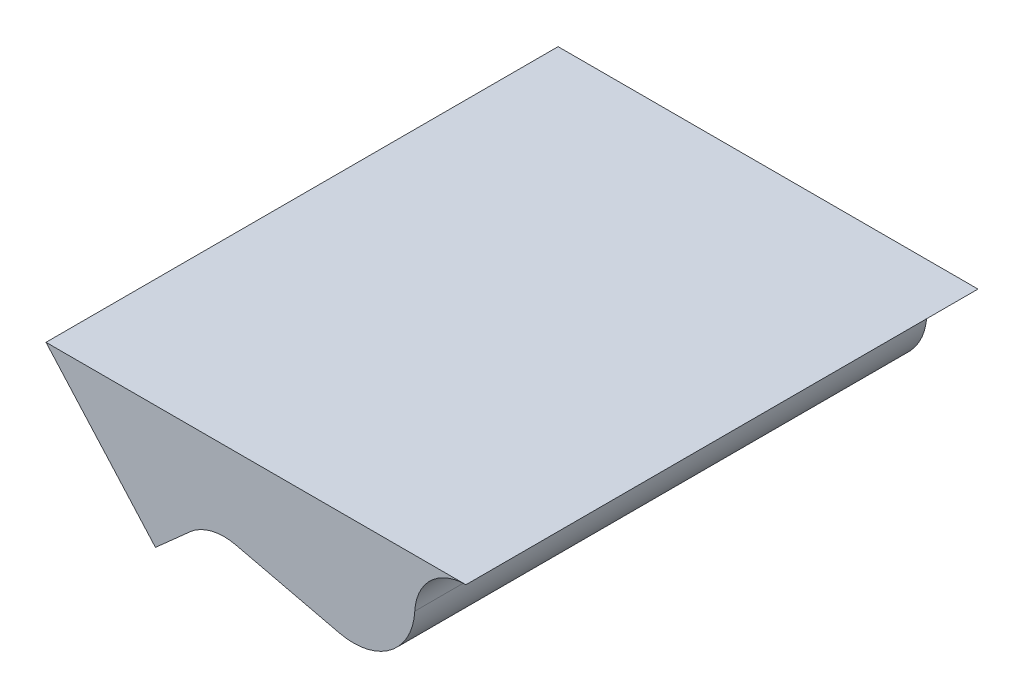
ISO-10303-21;
HEADER;
FILE_DESCRIPTION(('STEP AP214'),'2;1');
FILE_NAME('part.step','',(''),(''),'','','');
FILE_SCHEMA(('AUTOMOTIVE_DESIGN { 1 0 10303 214 1 1 1 1 }'));
ENDSEC;
DATA;
#1=APPLICATION_CONTEXT('core data for automotive mechanical design processes');
#2=APPLICATION_PROTOCOL_DEFINITION('international standard','automotive_design',2000,#1);
#3=PRODUCT_CONTEXT('',#1,'mechanical');
#4=PRODUCT('Part','Part','',(#3));
#5=PRODUCT_RELATED_PRODUCT_CATEGORY('part','',(#4));
#6=PRODUCT_DEFINITION_FORMATION('','',#4);
#7=PRODUCT_DEFINITION_CONTEXT('part definition',#1,'design');
#8=PRODUCT_DEFINITION('design','',#6,#7);
#9=PRODUCT_DEFINITION_SHAPE('','',#8);
#10=(LENGTH_UNIT() NAMED_UNIT(*) SI_UNIT(.MILLI.,.METRE.));
#11=(NAMED_UNIT(*) PLANE_ANGLE_UNIT() SI_UNIT($,.RADIAN.));
#12=(NAMED_UNIT(*) SI_UNIT($,.STERADIAN.) SOLID_ANGLE_UNIT());
#13=UNCERTAINTY_MEASURE_WITH_UNIT(LENGTH_MEASURE(1.E-05),#10,'distance_accuracy_value','');
#14=(GEOMETRIC_REPRESENTATION_CONTEXT(3) GLOBAL_UNCERTAINTY_ASSIGNED_CONTEXT((#13)) GLOBAL_UNIT_ASSIGNED_CONTEXT((#10,
#11,#12)) REPRESENTATION_CONTEXT('',''));
#15=CARTESIAN_POINT('',(0.,0.,0.));
#16=DIRECTION('',(0.,0.,1.));
#17=DIRECTION('',(1.,0.,0.));
#18=AXIS2_PLACEMENT_3D('',#15,#16,#17);
#19=CARTESIAN_POINT('',(-3.65588701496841,-6.,12.5));
#20=DIRECTION('',(-0.746742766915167,-0.665112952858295,0.));
#21=DIRECTION('',(0.665112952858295,-0.746742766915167,0.));
#22=AXIS2_PLACEMENT_3D('',#19,#20,#21);
#23=PLANE('',#22);
#24=DIRECTION('',(-0.665112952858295,0.746742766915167,0.));
#25=VECTOR('',#24,1.);
#26=CARTESIAN_POINT('',(-3.65588701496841,-6.,-12.5));
#27=LINE('',#26,#25);
#28=CARTESIAN_POINT('',(-3.65588701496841,-6.,-12.5));
#29=VERTEX_POINT('',#28);
#30=CARTESIAN_POINT('',(-9.,0.,-12.5));
#31=VERTEX_POINT('',#30);
#32=EDGE_CURVE('E110',#29,#31,#27,.T.);
#33=ORIENTED_EDGE('',*,*,#32,.F.);
#34=DIRECTION('',(0.,0.,-1.));
#35=VECTOR('',#34,1.);
#36=CARTESIAN_POINT('',(-3.65588701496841,-6.,12.5));
#37=LINE('',#36,#35);
#38=CARTESIAN_POINT('',(-3.65588701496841,-6.,12.5));
#39=VERTEX_POINT('',#38);
#40=EDGE_CURVE('E144',#39,#29,#37,.T.);
#41=ORIENTED_EDGE('',*,*,#40,.F.);
#42=DIRECTION('',(-0.665112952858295,0.746742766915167,0.));
#43=VECTOR('',#42,1.);
#44=CARTESIAN_POINT('',(-3.65588701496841,-6.,12.5));
#45=LINE('',#44,#43);
#46=CARTESIAN_POINT('',(-9.,0.,12.5));
#47=VERTEX_POINT('',#46);
#48=EDGE_CURVE('E149',#39,#47,#45,.T.);
#49=ORIENTED_EDGE('',*,*,#48,.T.);
#50=DIRECTION('',(0.,0.,-1.));
#51=VECTOR('',#50,1.);
#52=CARTESIAN_POINT('',(-9.,0.,12.5));
#53=LINE('',#52,#51);
#54=EDGE_CURVE('E104',#47,#31,#53,.T.);
#55=ORIENTED_EDGE('',*,*,#54,.T.);
#56=EDGE_LOOP('',(#33,#41,#49,#55));
#57=FACE_BOUND('',#56,.T.);
#58=ADVANCED_FACE('F36',(#57),#23,.T.);
#59=CARTESIAN_POINT('',(-1.,-3.6344399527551,12.5));
#60=DIRECTION('',(0.665112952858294,-0.746742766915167,0.));
#61=DIRECTION('',(0.746742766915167,0.665112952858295,0.));
#62=AXIS2_PLACEMENT_3D('',#59,#60,#61);
#63=PLANE('',#62);
#64=DIRECTION('',(-0.746742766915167,-0.665112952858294,0.));
#65=VECTOR('',#64,1.);
#66=CARTESIAN_POINT('',(-1.,-3.6344399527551,-12.5));
#67=LINE('',#66,#65);
#68=CARTESIAN_POINT('',(-1.9718241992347,-4.50002967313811,-12.5));
#69=VERTEX_POINT('',#68);
#70=EDGE_CURVE('E155',#69,#29,#67,.T.);
#71=ORIENTED_EDGE('',*,*,#70,.F.);
#72=DIRECTION('',(0.,0.,-1.));
#73=VECTOR('',#72,1.);
#74=CARTESIAN_POINT('',(-1.9718241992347,-4.50002967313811,12.5));
#75=LINE('',#74,#73);
#76=CARTESIAN_POINT('',(-1.9718241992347,-4.50002967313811,12.5));
#77=VERTEX_POINT('',#76);
#78=EDGE_CURVE('E118',#69,#77,#75,.F.);
#79=ORIENTED_EDGE('',*,*,#78,.T.);
#80=DIRECTION('',(-0.746742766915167,-0.665112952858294,0.));
#81=VECTOR('',#80,1.);
#82=CARTESIAN_POINT('',(-1.,-3.6344399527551,12.5));
#83=LINE('',#82,#81);
#84=EDGE_CURVE('E137',#77,#39,#83,.T.);
#85=ORIENTED_EDGE('',*,*,#84,.T.);
#86=ORIENTED_EDGE('',*,*,#40,.T.);
#87=EDGE_LOOP('',(#71,#79,#85,#86));
#88=FACE_BOUND('',#87,.T.);
#89=ADVANCED_FACE('F164',(#88),#63,.T.);
#90=CARTESIAN_POINT('',(9.,-6.,12.5));
#91=DIRECTION('',(-0.230202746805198,-0.973142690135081,0.));
#92=DIRECTION('',(0.973142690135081,-0.230202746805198,0.));
#93=AXIS2_PLACEMENT_3D('',#90,#91,#92);
#94=PLANE('',#93);
#95=DIRECTION('',(-0.973142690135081,0.230202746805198,0.));
#96=VECTOR('',#95,1.);
#97=CARTESIAN_POINT('',(9.,-6.,-12.5));
#98=LINE('',#97,#96);
#99=CARTESIAN_POINT('',(5.31707666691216,-5.12878237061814,-12.5));
#100=VERTEX_POINT('',#99);
#101=CARTESIAN_POINT('',(0.266465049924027,-3.93402986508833,-12.5));
#102=VERTEX_POINT('',#101);
#103=EDGE_CURVE('E157',#100,#102,#98,.T.);
#104=ORIENTED_EDGE('',*,*,#103,.F.);
#105=DIRECTION('',(0.,0.,-1.));
#106=VECTOR('',#105,1.);
#107=CARTESIAN_POINT('',(5.31707666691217,-5.12878237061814,12.5));
#108=LINE('',#107,#106);
#109=CARTESIAN_POINT('',(5.31707666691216,-5.12878237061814,12.5));
#110=VERTEX_POINT('',#109);
#111=EDGE_CURVE('E44',#100,#110,#108,.F.);
#112=ORIENTED_EDGE('',*,*,#111,.T.);
#113=DIRECTION('',(-0.973142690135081,0.230202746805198,0.));
#114=VECTOR('',#113,1.);
#115=CARTESIAN_POINT('',(9.,-6.,12.5));
#116=LINE('',#115,#114);
#117=CARTESIAN_POINT('',(0.266465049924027,-3.93402986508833,12.5));
#118=VERTEX_POINT('',#117);
#119=EDGE_CURVE('E111',#110,#118,#116,.T.);
#120=ORIENTED_EDGE('',*,*,#119,.T.);
#121=DIRECTION('',(0.,0.,-1.));
#122=VECTOR('',#121,1.);
#123=CARTESIAN_POINT('',(0.26646504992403,-3.93402986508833,-12.5));
#124=LINE('',#123,#122);
#125=EDGE_CURVE('E103',#118,#102,#124,.T.);
#126=ORIENTED_EDGE('',*,*,#125,.T.);
#127=EDGE_LOOP('',(#104,#112,#120,#126));
#128=FACE_BOUND('',#127,.T.);
#129=ADVANCED_FACE('F38',(#128),#94,.T.);
#130=CARTESIAN_POINT('',(9.,0.,12.5));
#131=DIRECTION('',(0.,0.,-1.));
#132=DIRECTION('',(-1.,0.,0.));
#133=AXIS2_PLACEMENT_3D('',#130,#131,#132);
#134=PLANE('',#133);
#135=ORIENTED_EDGE('',*,*,#119,.F.);
#136=CARTESIAN_POINT('',(6.00768490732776,-2.2093543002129,12.5));
#137=DIRECTION('',(0.,0.,-1.));
#138=DIRECTION('',(-1.,0.,0.));
#139=AXIS2_PLACEMENT_3D('',#136,#137,#138);
#140=CIRCLE('',#139,3.);
#141=CARTESIAN_POINT('',(9.00349313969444,-2.36788831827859,12.5));
#142=VERTEX_POINT('',#141);
#143=EDGE_CURVE('E11',#110,#142,#140,.F.);
#144=ORIENTED_EDGE('',*,*,#143,.T.);
#145=CARTESIAN_POINT('',(11.5,-2.5,12.5));
#146=DIRECTION('',(0.,0.,-1.));
#147=DIRECTION('',(-1.,0.,0.));
#148=AXIS2_PLACEMENT_3D('',#145,#146,#147);
#149=CIRCLE('',#148,2.5);
#150=CARTESIAN_POINT('',(11.5,0.,12.5));
#151=VERTEX_POINT('',#150);
#152=EDGE_CURVE('E117',#142,#151,#149,.T.);
#153=ORIENTED_EDGE('',*,*,#152,.T.);
#154=DIRECTION('',(-1.,0.,0.));
#155=VECTOR('',#154,1.);
#156=CARTESIAN_POINT('',(9.,0.,12.5));
#157=LINE('',#156,#155);
#158=EDGE_CURVE('E98',#151,#47,#157,.T.);
#159=ORIENTED_EDGE('',*,*,#158,.T.);
#160=ORIENTED_EDGE('',*,*,#48,.F.);
#161=ORIENTED_EDGE('',*,*,#84,.F.);
#162=CARTESIAN_POINT('',(-0.309041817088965,-6.36688659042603,12.5));
#163=DIRECTION('',(0.,0.,-1.));
#164=DIRECTION('',(-1.,0.,0.));
#165=AXIS2_PLACEMENT_3D('',#162,#163,#164);
#166=CIRCLE('',#165,2.5);
#167=EDGE_CURVE('E126',#77,#118,#166,.T.);
#168=ORIENTED_EDGE('',*,*,#167,.T.);
#169=EDGE_LOOP('',(#135,#144,#153,#159,#160,#161,#168));
#170=FACE_BOUND('',#169,.T.);
#171=ADVANCED_FACE('F134',(#170),#134,.F.);
#172=CARTESIAN_POINT('',(9.,0.,-12.5));
#173=DIRECTION('',(0.,0.,-1.));
#174=DIRECTION('',(-1.,0.,0.));
#175=AXIS2_PLACEMENT_3D('',#172,#173,#174);
#176=PLANE('',#175);
#177=CARTESIAN_POINT('',(11.5,-2.5,-12.5));
#178=DIRECTION('',(0.,0.,-1.));
#179=DIRECTION('',(-1.,0.,0.));
#180=AXIS2_PLACEMENT_3D('',#177,#178,#179);
#181=CIRCLE('',#180,2.5);
#182=CARTESIAN_POINT('',(11.5,0.,-12.5));
#183=VERTEX_POINT('',#182);
#184=CARTESIAN_POINT('',(9.00349313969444,-2.36788831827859,-12.5));
#185=VERTEX_POINT('',#184);
#186=EDGE_CURVE('E108',#183,#185,#181,.F.);
#187=ORIENTED_EDGE('',*,*,#186,.T.);
#188=CARTESIAN_POINT('',(6.00768490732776,-2.2093543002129,-12.5));
#189=DIRECTION('',(0.,0.,-1.));
#190=DIRECTION('',(-1.,0.,0.));
#191=AXIS2_PLACEMENT_3D('',#188,#189,#190);
#192=CIRCLE('',#191,3.);
#193=EDGE_CURVE('E58',#185,#100,#192,.T.);
#194=ORIENTED_EDGE('',*,*,#193,.T.);
#195=ORIENTED_EDGE('',*,*,#103,.T.);
#196=CARTESIAN_POINT('',(-0.309041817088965,-6.36688659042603,-12.5));
#197=DIRECTION('',(0.,0.,-1.));
#198=DIRECTION('',(-1.,0.,0.));
#199=AXIS2_PLACEMENT_3D('',#196,#197,#198);
#200=CIRCLE('',#199,2.5);
#201=EDGE_CURVE('E120',#102,#69,#200,.F.);
#202=ORIENTED_EDGE('',*,*,#201,.T.);
#203=ORIENTED_EDGE('',*,*,#70,.T.);
#204=ORIENTED_EDGE('',*,*,#32,.T.);
#205=DIRECTION('',(-1.,0.,0.));
#206=VECTOR('',#205,1.);
#207=CARTESIAN_POINT('',(9.,0.,-12.5));
#208=LINE('',#207,#206);
#209=EDGE_CURVE('E95',#183,#31,#208,.T.);
#210=ORIENTED_EDGE('',*,*,#209,.F.);
#211=EDGE_LOOP('',(#187,#194,#195,#202,#203,#204,#210));
#212=FACE_BOUND('',#211,.T.);
#213=ADVANCED_FACE('F107',(#212),#176,.T.);
#214=CARTESIAN_POINT('',(11.5,-2.5,25.));
#215=DIRECTION('',(0.,0.,1.));
#216=DIRECTION('',(1.,0.,0.));
#217=AXIS2_PLACEMENT_3D('',#214,#215,#216);
#218=CYLINDRICAL_SURFACE('',#217,2.5);
#219=ORIENTED_EDGE('',*,*,#152,.F.);
#220=DIRECTION('',(0.,0.,1.));
#221=VECTOR('',#220,1.);
#222=CARTESIAN_POINT('',(9.00349313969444,-2.36788831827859,25.));
#223=LINE('',#222,#221);
#224=EDGE_CURVE('E116',#142,#185,#223,.F.);
#225=ORIENTED_EDGE('',*,*,#224,.T.);
#226=ORIENTED_EDGE('',*,*,#186,.F.);
#227=DIRECTION('',(0.,0.,-1.));
#228=VECTOR('',#227,1.);
#229=CARTESIAN_POINT('',(11.5,0.,-12.5));
#230=LINE('',#229,#228);
#231=EDGE_CURVE('E92',#151,#183,#230,.T.);
#232=ORIENTED_EDGE('',*,*,#231,.F.);
#233=EDGE_LOOP('',(#219,#225,#226,#232));
#234=FACE_BOUND('',#233,.T.);
#235=ADVANCED_FACE('F114',(#234),#218,.F.);
#236=CARTESIAN_POINT('',(-0.309041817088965,-6.36688659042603,12.5));
#237=DIRECTION('',(0.,0.,1.));
#238=DIRECTION('',(1.,0.,0.));
#239=AXIS2_PLACEMENT_3D('',#236,#237,#238);
#240=CYLINDRICAL_SURFACE('',#239,2.5);
#241=ORIENTED_EDGE('',*,*,#167,.F.);
#242=ORIENTED_EDGE('',*,*,#78,.F.);
#243=ORIENTED_EDGE('',*,*,#201,.F.);
#244=ORIENTED_EDGE('',*,*,#125,.F.);
#245=EDGE_LOOP('',(#241,#242,#243,#244));
#246=FACE_BOUND('',#245,.T.);
#247=ADVANCED_FACE('F142',(#246),#240,.F.);
#248=CARTESIAN_POINT('',(6.00768490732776,-2.2093543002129,25.));
#249=DIRECTION('',(0.,0.,1.));
#250=DIRECTION('',(1.,0.,0.));
#251=AXIS2_PLACEMENT_3D('',#248,#249,#250);
#252=CYLINDRICAL_SURFACE('',#251,3.);
#253=ORIENTED_EDGE('',*,*,#143,.F.);
#254=ORIENTED_EDGE('',*,*,#111,.F.);
#255=ORIENTED_EDGE('',*,*,#193,.F.);
#256=ORIENTED_EDGE('',*,*,#224,.F.);
#257=EDGE_LOOP('',(#253,#254,#255,#256));
#258=FACE_BOUND('',#257,.T.);
#259=ADVANCED_FACE('F160',(#258),#252,.T.);
#260=CARTESIAN_POINT('',(-25.,0.,25.));
#261=DIRECTION('',(0.,-1.,0.));
#262=DIRECTION('',(0.,0.,-1.));
#263=AXIS2_PLACEMENT_3D('',#260,#261,#262);
#264=PLANE('',#263);
#265=ORIENTED_EDGE('',*,*,#54,.F.);
#266=ORIENTED_EDGE('',*,*,#158,.F.);
#267=ORIENTED_EDGE('',*,*,#231,.T.);
#268=ORIENTED_EDGE('',*,*,#209,.T.);
#269=EDGE_LOOP('',(#265,#266,#267,#268));
#270=FACE_BOUND('',#269,.T.);
#271=ADVANCED_FACE('F94',(#270),#264,.F.);
#272=CLOSED_SHELL('',(#58,#89,#129,#171,#213,#235,#247,#259,#271));
#273=MANIFOLD_SOLID_BREP('B2',#272);
#274=ADVANCED_BREP_SHAPE_REPRESENTATION('',(#18,#273),#14);
#275=SHAPE_DEFINITION_REPRESENTATION(#9,#274);
ENDSEC;
END-ISO-10303-21;
